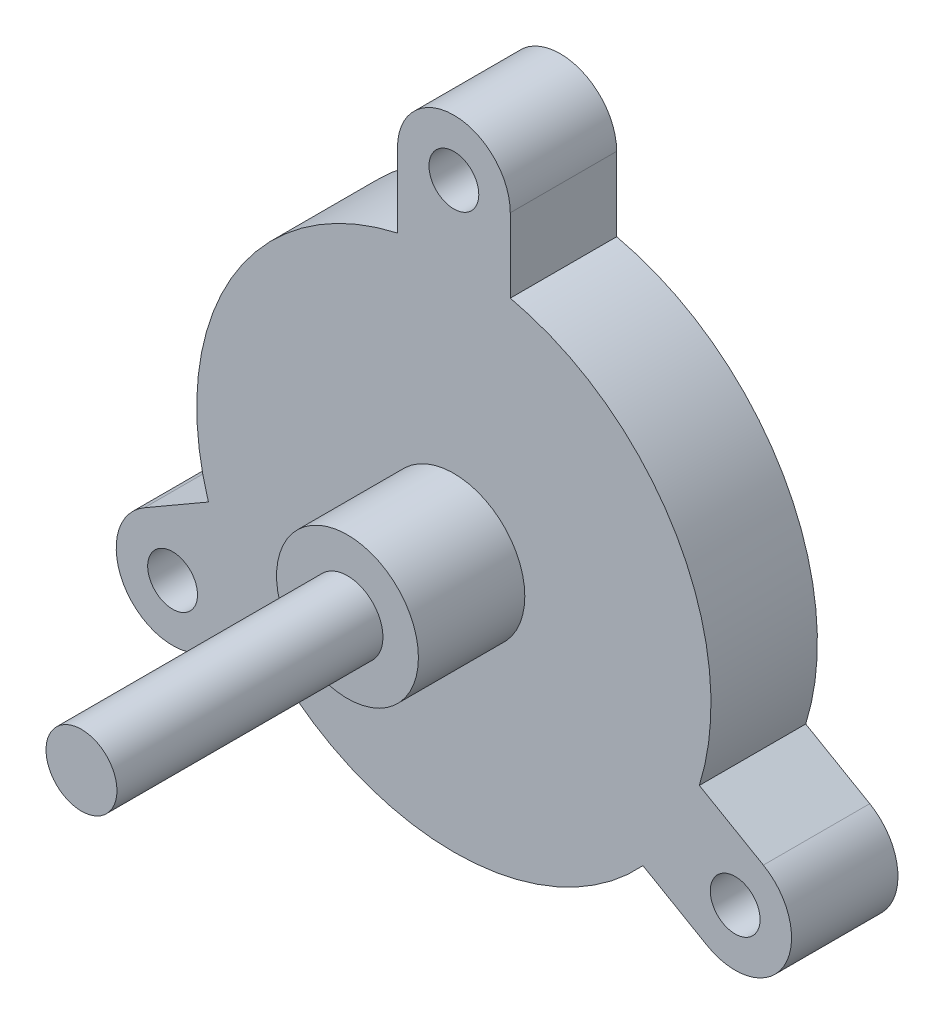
ISO-10303-21;
HEADER;
FILE_DESCRIPTION(('STEP AP214'),'2;1');
FILE_NAME('part.step','',(''),(''),'','','');
FILE_SCHEMA(('AUTOMOTIVE_DESIGN { 1 0 10303 214 1 1 1 1 }'));
ENDSEC;
DATA;
#1=APPLICATION_CONTEXT('core data for automotive mechanical design processes');
#2=APPLICATION_PROTOCOL_DEFINITION('international standard','automotive_design',2000,#1);
#3=PRODUCT_CONTEXT('',#1,'mechanical');
#4=PRODUCT('Part','Part','',(#3));
#5=PRODUCT_RELATED_PRODUCT_CATEGORY('part','',(#4));
#6=PRODUCT_DEFINITION_FORMATION('','',#4);
#7=PRODUCT_DEFINITION_CONTEXT('part definition',#1,'design');
#8=PRODUCT_DEFINITION('design','',#6,#7);
#9=PRODUCT_DEFINITION_SHAPE('','',#8);
#10=(LENGTH_UNIT() NAMED_UNIT(*) SI_UNIT(.MILLI.,.METRE.));
#11=(NAMED_UNIT(*) PLANE_ANGLE_UNIT() SI_UNIT($,.RADIAN.));
#12=(NAMED_UNIT(*) SI_UNIT($,.STERADIAN.) SOLID_ANGLE_UNIT());
#13=UNCERTAINTY_MEASURE_WITH_UNIT(LENGTH_MEASURE(1.E-05),#10,'distance_accuracy_value','');
#14=(GEOMETRIC_REPRESENTATION_CONTEXT(3) GLOBAL_UNCERTAINTY_ASSIGNED_CONTEXT((#13)) GLOBAL_UNIT_ASSIGNED_CONTEXT((#10,
#11,#12)) REPRESENTATION_CONTEXT('',''));
#15=CARTESIAN_POINT('',(0.,0.,0.));
#16=DIRECTION('',(0.,0.,1.));
#17=DIRECTION('',(1.,0.,0.));
#18=AXIS2_PLACEMENT_3D('',#15,#16,#17);
#19=CARTESIAN_POINT('',(0.,0.,6.));
#20=DIRECTION('',(0.,0.,1.));
#21=DIRECTION('',(1.,0.,0.));
#22=AXIS2_PLACEMENT_3D('',#19,#20,#21);
#23=PLANE('',#22);
#24=CARTESIAN_POINT('',(-15.8629870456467,-9.15849984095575,6.));
#25=DIRECTION('',(0.,0.,1.));
#26=DIRECTION('',(1.,0.,0.));
#27=AXIS2_PLACEMENT_3D('',#24,#25,#26);
#28=CIRCLE('',#27,1.405);
#29=CARTESIAN_POINT('',(-14.4579870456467,-9.15849984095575,6.));
#30=VERTEX_POINT('',#29);
#31=EDGE_CURVE('E241',#30,#30,#28,.T.);
#32=ORIENTED_EDGE('',*,*,#31,.F.);
#33=EDGE_LOOP('',(#32));
#34=FACE_BOUND('',#33,.T.);
#35=CARTESIAN_POINT('',(15.8629870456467,-9.15849984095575,6.));
#36=DIRECTION('',(0.,0.,1.));
#37=DIRECTION('',(-1.,0.,0.));
#38=AXIS2_PLACEMENT_3D('',#35,#36,#37);
#39=CIRCLE('',#38,1.405);
#40=CARTESIAN_POINT('',(14.4579870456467,-9.15849984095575,6.));
#41=VERTEX_POINT('',#40);
#42=EDGE_CURVE('E223',#41,#41,#39,.T.);
#43=ORIENTED_EDGE('',*,*,#42,.F.);
#44=EDGE_LOOP('',(#43));
#45=FACE_BOUND('',#44,.T.);
#46=CARTESIAN_POINT('',(0.,18.3169996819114,6.));
#47=DIRECTION('',(0.,0.,1.));
#48=DIRECTION('',(1.,0.,0.));
#49=AXIS2_PLACEMENT_3D('',#46,#47,#48);
#50=CIRCLE('',#49,1.405);
#51=CARTESIAN_POINT('',(1.405,18.3169996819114,6.));
#52=VERTEX_POINT('',#51);
#53=EDGE_CURVE('E195',#52,#52,#50,.T.);
#54=ORIENTED_EDGE('',*,*,#53,.F.);
#55=EDGE_LOOP('',(#54));
#56=FACE_BOUND('',#55,.T.);
#57=CARTESIAN_POINT('',(0.,0.,6.));
#58=DIRECTION('',(0.,0.,1.));
#59=DIRECTION('',(1.,0.,0.));
#60=AXIS2_PLACEMENT_3D('',#57,#58,#59);
#61=CIRCLE('',#60,14.5);
#62=CARTESIAN_POINT('',(-3.18,14.1469996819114,6.));
#63=VERTEX_POINT('',#62);
#64=CARTESIAN_POINT('',(-13.8416611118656,-4.31953905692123,6.));
#65=VERTEX_POINT('',#64);
#66=EDGE_CURVE('E11',#63,#65,#61,.T.);
#67=ORIENTED_EDGE('',*,*,#66,.T.);
#68=DIRECTION('',(-0.866025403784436,-0.500000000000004,0.));
#69=VECTOR('',#68,1.);
#70=CARTESIAN_POINT('',(-13.8416611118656,-4.31953905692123,6.));
#71=LINE('',#70,#69);
#72=CARTESIAN_POINT('',(-17.4529870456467,-6.40453905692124,6.));
#73=VERTEX_POINT('',#72);
#74=EDGE_CURVE('E119',#65,#73,#71,.T.);
#75=ORIENTED_EDGE('',*,*,#74,.T.);
#76=CARTESIAN_POINT('',(-15.8629870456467,-9.15849984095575,6.));
#77=DIRECTION('',(0.,0.,1.));
#78=DIRECTION('',(-1.,0.,0.));
#79=AXIS2_PLACEMENT_3D('',#76,#77,#78);
#80=CIRCLE('',#79,3.18);
#81=CARTESIAN_POINT('',(-14.2729870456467,-11.9124606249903,6.));
#82=VERTEX_POINT('',#81);
#83=EDGE_CURVE('E127',#73,#82,#80,.T.);
#84=ORIENTED_EDGE('',*,*,#83,.T.);
#85=DIRECTION('',(0.866025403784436,0.500000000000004,0.));
#86=VECTOR('',#85,1.);
#87=CARTESIAN_POINT('',(-10.6616611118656,-9.82746062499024,6.));
#88=LINE('',#87,#86);
#89=CARTESIAN_POINT('',(-10.6616611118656,-9.82746062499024,6.));
#90=VERTEX_POINT('',#89);
#91=EDGE_CURVE('E45',#82,#90,#88,.T.);
#92=ORIENTED_EDGE('',*,*,#91,.T.);
#93=CARTESIAN_POINT('',(10.6616611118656,-9.82746062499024,6.));
#94=VERTEX_POINT('',#93);
#95=EDGE_CURVE('E37',#90,#94,#61,.T.);
#96=ORIENTED_EDGE('',*,*,#95,.T.);
#97=DIRECTION('',(0.866025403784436,-0.500000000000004,0.));
#98=VECTOR('',#97,1.);
#99=CARTESIAN_POINT('',(10.6616611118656,-9.82746062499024,6.));
#100=LINE('',#99,#98);
#101=CARTESIAN_POINT('',(14.2729870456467,-11.9124606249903,6.));
#102=VERTEX_POINT('',#101);
#103=EDGE_CURVE('E217',#94,#102,#100,.T.);
#104=ORIENTED_EDGE('',*,*,#103,.T.);
#105=CARTESIAN_POINT('',(15.8629870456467,-9.15849984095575,6.));
#106=DIRECTION('',(0.,0.,1.));
#107=DIRECTION('',(1.,0.,0.));
#108=AXIS2_PLACEMENT_3D('',#105,#106,#107);
#109=CIRCLE('',#108,3.18);
#110=CARTESIAN_POINT('',(17.4529870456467,-6.40453905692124,6.));
#111=VERTEX_POINT('',#110);
#112=EDGE_CURVE('E215',#102,#111,#109,.T.);
#113=ORIENTED_EDGE('',*,*,#112,.T.);
#114=DIRECTION('',(-0.866025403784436,0.500000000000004,0.));
#115=VECTOR('',#114,1.);
#116=CARTESIAN_POINT('',(13.8416611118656,-4.31953905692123,6.));
#117=LINE('',#116,#115);
#118=CARTESIAN_POINT('',(13.8416611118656,-4.31953905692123,6.));
#119=VERTEX_POINT('',#118);
#120=EDGE_CURVE('E52',#111,#119,#117,.T.);
#121=ORIENTED_EDGE('',*,*,#120,.T.);
#122=CARTESIAN_POINT('',(3.18,14.1469996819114,6.));
#123=VERTEX_POINT('',#122);
#124=EDGE_CURVE('E38',#119,#123,#61,.T.);
#125=ORIENTED_EDGE('',*,*,#124,.T.);
#126=DIRECTION('',(0.,1.,0.));
#127=VECTOR('',#126,1.);
#128=CARTESIAN_POINT('',(3.18,14.1469996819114,6.));
#129=LINE('',#128,#127);
#130=CARTESIAN_POINT('',(3.18,18.3169996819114,6.));
#131=VERTEX_POINT('',#130);
#132=EDGE_CURVE('E182',#123,#131,#129,.T.);
#133=ORIENTED_EDGE('',*,*,#132,.T.);
#134=CARTESIAN_POINT('',(0.,18.3169996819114,6.));
#135=DIRECTION('',(0.,0.,1.));
#136=DIRECTION('',(-1.,0.,0.));
#137=AXIS2_PLACEMENT_3D('',#134,#135,#136);
#138=CIRCLE('',#137,3.18);
#139=CARTESIAN_POINT('',(-3.18,18.3169996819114,6.));
#140=VERTEX_POINT('',#139);
#141=EDGE_CURVE('E145',#131,#140,#138,.T.);
#142=ORIENTED_EDGE('',*,*,#141,.T.);
#143=DIRECTION('',(0.,-1.,0.));
#144=VECTOR('',#143,1.);
#145=CARTESIAN_POINT('',(-3.18,14.1469996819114,6.));
#146=LINE('',#145,#144);
#147=EDGE_CURVE('E141',#140,#63,#146,.T.);
#148=ORIENTED_EDGE('',*,*,#147,.T.);
#149=EDGE_LOOP('',(#67,#75,#84,#92,#96,#104,#113,#121,#125,#133,#142,#148));
#150=FACE_BOUND('',#149,.T.);
#151=CARTESIAN_POINT('',(0.,0.,6.));
#152=DIRECTION('',(0.,0.,1.));
#153=DIRECTION('',(1.,0.,0.));
#154=AXIS2_PLACEMENT_3D('',#151,#152,#153);
#155=CIRCLE('',#154,4.);
#156=CARTESIAN_POINT('',(4.,0.,6.));
#157=VERTEX_POINT('',#156);
#158=EDGE_CURVE('E256',#157,#157,#155,.T.);
#159=ORIENTED_EDGE('',*,*,#158,.F.);
#160=EDGE_LOOP('',(#159));
#161=FACE_BOUND('',#160,.T.);
#162=ADVANCED_FACE('F29',(#34,#45,#56,#150,#161),#23,.T.);
#163=CARTESIAN_POINT('',(0.,0.,6.));
#164=DIRECTION('',(0.,0.,-1.));
#165=DIRECTION('',(-1.,0.,0.));
#166=AXIS2_PLACEMENT_3D('',#163,#164,#165);
#167=CYLINDRICAL_SURFACE('',#166,12.5);
#168=CARTESIAN_POINT('',(0.,0.,0.));
#169=DIRECTION('',(0.,0.,1.));
#170=DIRECTION('',(1.,0.,0.));
#171=AXIS2_PLACEMENT_3D('',#168,#169,#170);
#172=CIRCLE('',#171,12.5);
#173=CARTESIAN_POINT('',(12.5,0.,0.));
#174=VERTEX_POINT('',#173);
#175=EDGE_CURVE('E153',#174,#174,#172,.T.);
#176=ORIENTED_EDGE('',*,*,#175,.F.);
#177=EDGE_LOOP('',(#176));
#178=FACE_BOUND('',#177,.T.);
#179=CARTESIAN_POINT('',(0.,0.,4.));
#180=DIRECTION('',(0.,0.,1.));
#181=DIRECTION('',(1.,0.,0.));
#182=AXIS2_PLACEMENT_3D('',#179,#180,#181);
#183=CIRCLE('',#182,12.5);
#184=CARTESIAN_POINT('',(12.5,0.,4.));
#185=VERTEX_POINT('',#184);
#186=EDGE_CURVE('E244',#185,#185,#183,.T.);
#187=ORIENTED_EDGE('',*,*,#186,.T.);
#188=EDGE_LOOP('',(#187));
#189=FACE_BOUND('',#188,.T.);
#190=ADVANCED_FACE('F292',(#178,#189),#167,.F.);
#191=CARTESIAN_POINT('',(0.,0.,6.));
#192=DIRECTION('',(0.,0.,-1.));
#193=DIRECTION('',(-1.,0.,0.));
#194=AXIS2_PLACEMENT_3D('',#191,#192,#193);
#195=CYLINDRICAL_SURFACE('',#194,14.5);
#196=ORIENTED_EDGE('',*,*,#95,.F.);
#197=DIRECTION('',(0.,0.,1.));
#198=VECTOR('',#197,1.);
#199=CARTESIAN_POINT('',(-10.6616611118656,-9.82746062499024,0.));
#200=LINE('',#199,#198);
#201=CARTESIAN_POINT('',(-10.6616611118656,-9.82746062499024,0.));
#202=VERTEX_POINT('',#201);
#203=EDGE_CURVE('E225',#202,#90,#200,.T.);
#204=ORIENTED_EDGE('',*,*,#203,.F.);
#205=CARTESIAN_POINT('',(0.,0.,0.));
#206=DIRECTION('',(0.,0.,1.));
#207=DIRECTION('',(1.,0.,0.));
#208=AXIS2_PLACEMENT_3D('',#205,#206,#207);
#209=CIRCLE('',#208,14.5);
#210=CARTESIAN_POINT('',(10.6616611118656,-9.82746062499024,0.));
#211=VERTEX_POINT('',#210);
#212=EDGE_CURVE('E167',#202,#211,#209,.T.);
#213=ORIENTED_EDGE('',*,*,#212,.T.);
#214=DIRECTION('',(0.,0.,1.));
#215=VECTOR('',#214,1.);
#216=CARTESIAN_POINT('',(10.6616611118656,-9.82746062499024,0.));
#217=LINE('',#216,#215);
#218=EDGE_CURVE('E198',#211,#94,#217,.T.);
#219=ORIENTED_EDGE('',*,*,#218,.T.);
#220=EDGE_LOOP('',(#196,#204,#213,#219));
#221=FACE_BOUND('',#220,.T.);
#222=ADVANCED_FACE('F297',(#221),#195,.T.);
#223=ORIENTED_EDGE('',*,*,#124,.F.);
#224=DIRECTION('',(0.,0.,1.));
#225=VECTOR('',#224,1.);
#226=CARTESIAN_POINT('',(13.8416611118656,-4.31953905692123,0.));
#227=LINE('',#226,#225);
#228=CARTESIAN_POINT('',(13.8416611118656,-4.31953905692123,0.));
#229=VERTEX_POINT('',#228);
#230=EDGE_CURVE('E174',#229,#119,#227,.T.);
#231=ORIENTED_EDGE('',*,*,#230,.F.);
#232=CARTESIAN_POINT('',(3.18,14.1469996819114,0.));
#233=VERTEX_POINT('',#232);
#234=EDGE_CURVE('E157',#229,#233,#209,.T.);
#235=ORIENTED_EDGE('',*,*,#234,.T.);
#236=DIRECTION('',(0.,0.,1.));
#237=VECTOR('',#236,1.);
#238=CARTESIAN_POINT('',(3.18,14.1469996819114,0.));
#239=LINE('',#238,#237);
#240=EDGE_CURVE('E165',#233,#123,#239,.T.);
#241=ORIENTED_EDGE('',*,*,#240,.T.);
#242=EDGE_LOOP('',(#223,#231,#235,#241));
#243=FACE_BOUND('',#242,.T.);
#244=ADVANCED_FACE('F173',(#243),#195,.T.);
#245=CARTESIAN_POINT('',(0.,0.,0.));
#246=DIRECTION('',(0.,0.,1.));
#247=DIRECTION('',(1.,0.,0.));
#248=AXIS2_PLACEMENT_3D('',#245,#246,#247);
#249=PLANE('',#248);
#250=CARTESIAN_POINT('',(-3.18,14.1469996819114,0.));
#251=VERTEX_POINT('',#250);
#252=CARTESIAN_POINT('',(-13.8416611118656,-4.31953905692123,0.));
#253=VERTEX_POINT('',#252);
#254=EDGE_CURVE('E135',#251,#253,#209,.T.);
#255=ORIENTED_EDGE('',*,*,#254,.F.);
#256=DIRECTION('',(0.,-1.,0.));
#257=VECTOR('',#256,1.);
#258=CARTESIAN_POINT('',(-3.18,14.1469996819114,0.));
#259=LINE('',#258,#257);
#260=CARTESIAN_POINT('',(-3.18,18.3169996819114,0.));
#261=VERTEX_POINT('',#260);
#262=EDGE_CURVE('E152',#261,#251,#259,.T.);
#263=ORIENTED_EDGE('',*,*,#262,.F.);
#264=CARTESIAN_POINT('',(0.,18.3169996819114,0.));
#265=DIRECTION('',(0.,0.,1.));
#266=DIRECTION('',(-1.,0.,0.));
#267=AXIS2_PLACEMENT_3D('',#264,#265,#266);
#268=CIRCLE('',#267,3.18);
#269=CARTESIAN_POINT('',(3.18,18.3169996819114,0.));
#270=VERTEX_POINT('',#269);
#271=EDGE_CURVE('E187',#270,#261,#268,.T.);
#272=ORIENTED_EDGE('',*,*,#271,.F.);
#273=DIRECTION('',(0.,1.,0.));
#274=VECTOR('',#273,1.);
#275=CARTESIAN_POINT('',(3.18,14.1469996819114,0.));
#276=LINE('',#275,#274);
#277=EDGE_CURVE('E147',#233,#270,#276,.T.);
#278=ORIENTED_EDGE('',*,*,#277,.F.);
#279=ORIENTED_EDGE('',*,*,#234,.F.);
#280=DIRECTION('',(-0.866025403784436,0.500000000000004,0.));
#281=VECTOR('',#280,1.);
#282=CARTESIAN_POINT('',(13.8416611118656,-4.31953905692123,0.));
#283=LINE('',#282,#281);
#284=CARTESIAN_POINT('',(17.4529870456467,-6.40453905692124,0.));
#285=VERTEX_POINT('',#284);
#286=EDGE_CURVE('E202',#285,#229,#283,.T.);
#287=ORIENTED_EDGE('',*,*,#286,.F.);
#288=CARTESIAN_POINT('',(15.8629870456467,-9.15849984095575,0.));
#289=DIRECTION('',(0.,0.,1.));
#290=DIRECTION('',(1.,0.,0.));
#291=AXIS2_PLACEMENT_3D('',#288,#289,#290);
#292=CIRCLE('',#291,3.18);
#293=CARTESIAN_POINT('',(14.2729870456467,-11.9124606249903,0.));
#294=VERTEX_POINT('',#293);
#295=EDGE_CURVE('E208',#294,#285,#292,.T.);
#296=ORIENTED_EDGE('',*,*,#295,.F.);
#297=DIRECTION('',(0.866025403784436,-0.500000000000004,0.));
#298=VECTOR('',#297,1.);
#299=CARTESIAN_POINT('',(10.6616611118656,-9.82746062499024,0.));
#300=LINE('',#299,#298);
#301=EDGE_CURVE('E211',#211,#294,#300,.T.);
#302=ORIENTED_EDGE('',*,*,#301,.F.);
#303=ORIENTED_EDGE('',*,*,#212,.F.);
#304=DIRECTION('',(0.866025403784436,0.500000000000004,0.));
#305=VECTOR('',#304,1.);
#306=CARTESIAN_POINT('',(-10.6616611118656,-9.82746062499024,0.));
#307=LINE('',#306,#305);
#308=CARTESIAN_POINT('',(-14.2729870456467,-11.9124606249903,0.));
#309=VERTEX_POINT('',#308);
#310=EDGE_CURVE('E136',#309,#202,#307,.T.);
#311=ORIENTED_EDGE('',*,*,#310,.F.);
#312=CARTESIAN_POINT('',(-15.8629870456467,-9.15849984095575,0.));
#313=DIRECTION('',(0.,0.,1.));
#314=DIRECTION('',(-1.,0.,0.));
#315=AXIS2_PLACEMENT_3D('',#312,#313,#314);
#316=CIRCLE('',#315,3.18);
#317=CARTESIAN_POINT('',(-17.4529870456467,-6.40453905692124,0.));
#318=VERTEX_POINT('',#317);
#319=EDGE_CURVE('E232',#318,#309,#316,.T.);
#320=ORIENTED_EDGE('',*,*,#319,.F.);
#321=DIRECTION('',(-0.866025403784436,-0.500000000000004,0.));
#322=VECTOR('',#321,1.);
#323=CARTESIAN_POINT('',(-13.8416611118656,-4.31953905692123,0.));
#324=LINE('',#323,#322);
#325=EDGE_CURVE('E235',#253,#318,#324,.T.);
#326=ORIENTED_EDGE('',*,*,#325,.F.);
#327=EDGE_LOOP('',(#255,#263,#272,#278,#279,#287,#296,#302,#303,#311,#320,#326));
#328=FACE_BOUND('',#327,.T.);
#329=ORIENTED_EDGE('',*,*,#175,.T.);
#330=EDGE_LOOP('',(#329));
#331=FACE_BOUND('',#330,.T.);
#332=CARTESIAN_POINT('',(0.,18.3169996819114,0.));
#333=DIRECTION('',(0.,0.,1.));
#334=DIRECTION('',(1.,0.,0.));
#335=AXIS2_PLACEMENT_3D('',#332,#333,#334);
#336=CIRCLE('',#335,1.405);
#337=CARTESIAN_POINT('',(1.405,18.3169996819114,0.));
#338=VERTEX_POINT('',#337);
#339=EDGE_CURVE('E192',#338,#338,#336,.T.);
#340=ORIENTED_EDGE('',*,*,#339,.T.);
#341=EDGE_LOOP('',(#340));
#342=FACE_BOUND('',#341,.T.);
#343=CARTESIAN_POINT('',(15.8629870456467,-9.15849984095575,0.));
#344=DIRECTION('',(0.,0.,1.));
#345=DIRECTION('',(-1.,0.,0.));
#346=AXIS2_PLACEMENT_3D('',#343,#344,#345);
#347=CIRCLE('',#346,1.405);
#348=CARTESIAN_POINT('',(14.4579870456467,-9.15849984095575,0.));
#349=VERTEX_POINT('',#348);
#350=EDGE_CURVE('E220',#349,#349,#347,.T.);
#351=ORIENTED_EDGE('',*,*,#350,.T.);
#352=EDGE_LOOP('',(#351));
#353=FACE_BOUND('',#352,.T.);
#354=CARTESIAN_POINT('',(-15.8629870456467,-9.15849984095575,0.));
#355=DIRECTION('',(0.,0.,1.));
#356=DIRECTION('',(1.,0.,0.));
#357=AXIS2_PLACEMENT_3D('',#354,#355,#356);
#358=CIRCLE('',#357,1.405);
#359=CARTESIAN_POINT('',(-14.4579870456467,-9.15849984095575,0.));
#360=VERTEX_POINT('',#359);
#361=EDGE_CURVE('E128',#360,#360,#358,.T.);
#362=ORIENTED_EDGE('',*,*,#361,.T.);
#363=EDGE_LOOP('',(#362));
#364=FACE_BOUND('',#363,.T.);
#365=ADVANCED_FACE('F184',(#328,#331,#342,#353,#364),#249,.F.);
#366=ORIENTED_EDGE('',*,*,#254,.T.);
#367=DIRECTION('',(0.,0.,1.));
#368=VECTOR('',#367,1.);
#369=CARTESIAN_POINT('',(-13.8416611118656,-4.31953905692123,0.));
#370=LINE('',#369,#368);
#371=EDGE_CURVE('E123',#253,#65,#370,.T.);
#372=ORIENTED_EDGE('',*,*,#371,.T.);
#373=ORIENTED_EDGE('',*,*,#66,.F.);
#374=DIRECTION('',(0.,0.,1.));
#375=VECTOR('',#374,1.);
#376=CARTESIAN_POINT('',(-3.18,14.1469996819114,0.));
#377=LINE('',#376,#375);
#378=EDGE_CURVE('E149',#251,#63,#377,.T.);
#379=ORIENTED_EDGE('',*,*,#378,.F.);
#380=EDGE_LOOP('',(#366,#372,#373,#379));
#381=FACE_BOUND('',#380,.T.);
#382=ADVANCED_FACE('F31',(#381),#195,.T.);
#383=CARTESIAN_POINT('',(-3.18,14.1469996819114,0.));
#384=DIRECTION('',(-1.,0.,0.));
#385=DIRECTION('',(0.,0.,1.));
#386=AXIS2_PLACEMENT_3D('',#383,#384,#385);
#387=PLANE('',#386);
#388=ORIENTED_EDGE('',*,*,#147,.F.);
#389=DIRECTION('',(0.,0.,1.));
#390=VECTOR('',#389,1.);
#391=CARTESIAN_POINT('',(-3.18,18.3169996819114,0.));
#392=LINE('',#391,#390);
#393=EDGE_CURVE('E154',#261,#140,#392,.T.);
#394=ORIENTED_EDGE('',*,*,#393,.F.);
#395=ORIENTED_EDGE('',*,*,#262,.T.);
#396=ORIENTED_EDGE('',*,*,#378,.T.);
#397=EDGE_LOOP('',(#388,#394,#395,#396));
#398=FACE_BOUND('',#397,.T.);
#399=ADVANCED_FACE('F150',(#398),#387,.T.);
#400=CARTESIAN_POINT('',(0.,18.3169996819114,0.));
#401=DIRECTION('',(0.,0.,1.));
#402=DIRECTION('',(1.,0.,0.));
#403=AXIS2_PLACEMENT_3D('',#400,#401,#402);
#404=CYLINDRICAL_SURFACE('',#403,3.18);
#405=ORIENTED_EDGE('',*,*,#141,.F.);
#406=DIRECTION('',(0.,0.,1.));
#407=VECTOR('',#406,1.);
#408=CARTESIAN_POINT('',(3.18,18.3169996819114,0.));
#409=LINE('',#408,#407);
#410=EDGE_CURVE('E159',#270,#131,#409,.T.);
#411=ORIENTED_EDGE('',*,*,#410,.F.);
#412=ORIENTED_EDGE('',*,*,#271,.T.);
#413=ORIENTED_EDGE('',*,*,#393,.T.);
#414=EDGE_LOOP('',(#405,#411,#412,#413));
#415=FACE_BOUND('',#414,.T.);
#416=ADVANCED_FACE('F308',(#415),#404,.T.);
#417=CARTESIAN_POINT('',(3.18,14.1469996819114,0.));
#418=DIRECTION('',(1.,0.,0.));
#419=DIRECTION('',(0.,0.,-1.));
#420=AXIS2_PLACEMENT_3D('',#417,#418,#419);
#421=PLANE('',#420);
#422=ORIENTED_EDGE('',*,*,#132,.F.);
#423=ORIENTED_EDGE('',*,*,#240,.F.);
#424=ORIENTED_EDGE('',*,*,#277,.T.);
#425=ORIENTED_EDGE('',*,*,#410,.T.);
#426=EDGE_LOOP('',(#422,#423,#424,#425));
#427=FACE_BOUND('',#426,.T.);
#428=ADVANCED_FACE('F181',(#427),#421,.T.);
#429=CARTESIAN_POINT('',(0.,18.3169996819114,0.));
#430=DIRECTION('',(0.,0.,1.));
#431=DIRECTION('',(1.,0.,0.));
#432=AXIS2_PLACEMENT_3D('',#429,#430,#431);
#433=CYLINDRICAL_SURFACE('',#432,1.405);
#434=ORIENTED_EDGE('',*,*,#339,.F.);
#435=EDGE_LOOP('',(#434));
#436=FACE_BOUND('',#435,.T.);
#437=ORIENTED_EDGE('',*,*,#53,.T.);
#438=EDGE_LOOP('',(#437));
#439=FACE_BOUND('',#438,.T.);
#440=ADVANCED_FACE('F307',(#436,#439),#433,.F.);
#441=CARTESIAN_POINT('',(13.8416611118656,-4.31953905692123,0.));
#442=DIRECTION('',(0.500000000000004,0.866025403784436,0.));
#443=DIRECTION('',(-0.866025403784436,0.500000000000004,0.));
#444=AXIS2_PLACEMENT_3D('',#441,#442,#443);
#445=PLANE('',#444);
#446=ORIENTED_EDGE('',*,*,#120,.F.);
#447=DIRECTION('',(0.,0.,1.));
#448=VECTOR('',#447,1.);
#449=CARTESIAN_POINT('',(17.4529870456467,-6.40453905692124,0.));
#450=LINE('',#449,#448);
#451=EDGE_CURVE('E204',#285,#111,#450,.T.);
#452=ORIENTED_EDGE('',*,*,#451,.F.);
#453=ORIENTED_EDGE('',*,*,#286,.T.);
#454=ORIENTED_EDGE('',*,*,#230,.T.);
#455=EDGE_LOOP('',(#446,#452,#453,#454));
#456=FACE_BOUND('',#455,.T.);
#457=ADVANCED_FACE('F316',(#456),#445,.T.);
#458=CARTESIAN_POINT('',(15.8629870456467,-9.15849984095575,0.));
#459=DIRECTION('',(0.,0.,1.));
#460=DIRECTION('',(1.,0.,0.));
#461=AXIS2_PLACEMENT_3D('',#458,#459,#460);
#462=CYLINDRICAL_SURFACE('',#461,3.18);
#463=ORIENTED_EDGE('',*,*,#112,.F.);
#464=DIRECTION('',(0.,0.,1.));
#465=VECTOR('',#464,1.);
#466=CARTESIAN_POINT('',(14.2729870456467,-11.9124606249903,0.));
#467=LINE('',#466,#465);
#468=EDGE_CURVE('E201',#294,#102,#467,.T.);
#469=ORIENTED_EDGE('',*,*,#468,.F.);
#470=ORIENTED_EDGE('',*,*,#295,.T.);
#471=ORIENTED_EDGE('',*,*,#451,.T.);
#472=EDGE_LOOP('',(#463,#469,#470,#471));
#473=FACE_BOUND('',#472,.T.);
#474=ADVANCED_FACE('F322',(#473),#462,.T.);
#475=CARTESIAN_POINT('',(10.6616611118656,-9.82746062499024,0.));
#476=DIRECTION('',(-0.500000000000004,-0.866025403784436,0.));
#477=DIRECTION('',(0.866025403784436,-0.500000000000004,0.));
#478=AXIS2_PLACEMENT_3D('',#475,#476,#477);
#479=PLANE('',#478);
#480=ORIENTED_EDGE('',*,*,#103,.F.);
#481=ORIENTED_EDGE('',*,*,#218,.F.);
#482=ORIENTED_EDGE('',*,*,#301,.T.);
#483=ORIENTED_EDGE('',*,*,#468,.T.);
#484=EDGE_LOOP('',(#480,#481,#482,#483));
#485=FACE_BOUND('',#484,.T.);
#486=ADVANCED_FACE('F318',(#485),#479,.T.);
#487=CARTESIAN_POINT('',(15.8629870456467,-9.15849984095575,0.));
#488=DIRECTION('',(0.,0.,1.));
#489=DIRECTION('',(1.,0.,0.));
#490=AXIS2_PLACEMENT_3D('',#487,#488,#489);
#491=CYLINDRICAL_SURFACE('',#490,1.405);
#492=ORIENTED_EDGE('',*,*,#350,.F.);
#493=EDGE_LOOP('',(#492));
#494=FACE_BOUND('',#493,.T.);
#495=ORIENTED_EDGE('',*,*,#42,.T.);
#496=EDGE_LOOP('',(#495));
#497=FACE_BOUND('',#496,.T.);
#498=ADVANCED_FACE('F321',(#494,#497),#491,.F.);
#499=CARTESIAN_POINT('',(-10.6616611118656,-9.82746062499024,0.));
#500=DIRECTION('',(0.500000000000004,-0.866025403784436,0.));
#501=DIRECTION('',(0.866025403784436,0.500000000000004,0.));
#502=AXIS2_PLACEMENT_3D('',#499,#500,#501);
#503=PLANE('',#502);
#504=ORIENTED_EDGE('',*,*,#91,.F.);
#505=DIRECTION('',(0.,0.,1.));
#506=VECTOR('',#505,1.);
#507=CARTESIAN_POINT('',(-14.2729870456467,-11.9124606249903,0.));
#508=LINE('',#507,#506);
#509=EDGE_CURVE('E228',#309,#82,#508,.T.);
#510=ORIENTED_EDGE('',*,*,#509,.F.);
#511=ORIENTED_EDGE('',*,*,#310,.T.);
#512=ORIENTED_EDGE('',*,*,#203,.T.);
#513=EDGE_LOOP('',(#504,#510,#511,#512));
#514=FACE_BOUND('',#513,.T.);
#515=ADVANCED_FACE('F332',(#514),#503,.T.);
#516=CARTESIAN_POINT('',(-15.8629870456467,-9.15849984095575,0.));
#517=DIRECTION('',(0.,0.,1.));
#518=DIRECTION('',(1.,0.,0.));
#519=AXIS2_PLACEMENT_3D('',#516,#517,#518);
#520=CYLINDRICAL_SURFACE('',#519,3.18);
#521=ORIENTED_EDGE('',*,*,#83,.F.);
#522=DIRECTION('',(0.,0.,1.));
#523=VECTOR('',#522,1.);
#524=CARTESIAN_POINT('',(-17.4529870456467,-6.40453905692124,0.));
#525=LINE('',#524,#523);
#526=EDGE_CURVE('E125',#318,#73,#525,.T.);
#527=ORIENTED_EDGE('',*,*,#526,.F.);
#528=ORIENTED_EDGE('',*,*,#319,.T.);
#529=ORIENTED_EDGE('',*,*,#509,.T.);
#530=EDGE_LOOP('',(#521,#527,#528,#529));
#531=FACE_BOUND('',#530,.T.);
#532=ADVANCED_FACE('F337',(#531),#520,.T.);
#533=CARTESIAN_POINT('',(-13.8416611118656,-4.31953905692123,0.));
#534=DIRECTION('',(-0.500000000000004,0.866025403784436,0.));
#535=DIRECTION('',(-0.866025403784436,-0.500000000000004,0.));
#536=AXIS2_PLACEMENT_3D('',#533,#534,#535);
#537=PLANE('',#536);
#538=ORIENTED_EDGE('',*,*,#74,.F.);
#539=ORIENTED_EDGE('',*,*,#371,.F.);
#540=ORIENTED_EDGE('',*,*,#325,.T.);
#541=ORIENTED_EDGE('',*,*,#526,.T.);
#542=EDGE_LOOP('',(#538,#539,#540,#541));
#543=FACE_BOUND('',#542,.T.);
#544=ADVANCED_FACE('F121',(#543),#537,.T.);
#545=CARTESIAN_POINT('',(-15.8629870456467,-9.15849984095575,0.));
#546=DIRECTION('',(0.,0.,1.));
#547=DIRECTION('',(1.,0.,0.));
#548=AXIS2_PLACEMENT_3D('',#545,#546,#547);
#549=CYLINDRICAL_SURFACE('',#548,1.405);
#550=ORIENTED_EDGE('',*,*,#361,.F.);
#551=EDGE_LOOP('',(#550));
#552=FACE_BOUND('',#551,.T.);
#553=ORIENTED_EDGE('',*,*,#31,.T.);
#554=EDGE_LOOP('',(#553));
#555=FACE_BOUND('',#554,.T.);
#556=ADVANCED_FACE('F336',(#552,#555),#549,.F.);
#557=CARTESIAN_POINT('',(0.,0.,4.));
#558=DIRECTION('',(0.,0.,1.));
#559=DIRECTION('',(1.,0.,0.));
#560=AXIS2_PLACEMENT_3D('',#557,#558,#559);
#561=PLANE('',#560);
#562=CARTESIAN_POINT('',(0.,0.,4.));
#563=DIRECTION('',(0.,0.,1.));
#564=DIRECTION('',(1.,0.,0.));
#565=AXIS2_PLACEMENT_3D('',#562,#563,#564);
#566=CIRCLE('',#565,2.1);
#567=CARTESIAN_POINT('',(2.1,0.,4.));
#568=VERTEX_POINT('',#567);
#569=EDGE_CURVE('E247',#568,#568,#566,.T.);
#570=ORIENTED_EDGE('',*,*,#569,.T.);
#571=EDGE_LOOP('',(#570));
#572=FACE_BOUND('',#571,.T.);
#573=ORIENTED_EDGE('',*,*,#186,.F.);
#574=EDGE_LOOP('',(#573));
#575=FACE_BOUND('',#574,.T.);
#576=ADVANCED_FACE('F346',(#572,#575),#561,.F.);
#577=CARTESIAN_POINT('',(0.,0.,4.));
#578=DIRECTION('',(0.,0.,1.));
#579=DIRECTION('',(1.,0.,0.));
#580=AXIS2_PLACEMENT_3D('',#577,#578,#579);
#581=CYLINDRICAL_SURFACE('',#580,2.1);
#582=ORIENTED_EDGE('',*,*,#569,.F.);
#583=EDGE_LOOP('',(#582));
#584=FACE_BOUND('',#583,.T.);
#585=CARTESIAN_POINT('',(0.,0.,6.));
#586=DIRECTION('',(0.,0.,1.));
#587=DIRECTION('',(1.,0.,0.));
#588=AXIS2_PLACEMENT_3D('',#585,#586,#587);
#589=CIRCLE('',#588,2.1);
#590=CARTESIAN_POINT('',(2.1,0.,6.));
#591=VERTEX_POINT('',#590);
#592=EDGE_CURVE('E250',#591,#591,#589,.F.);
#593=ORIENTED_EDGE('',*,*,#592,.F.);
#594=EDGE_LOOP('',(#593));
#595=FACE_BOUND('',#594,.T.);
#596=ADVANCED_FACE('F350',(#584,#595),#581,.F.);
#597=CARTESIAN_POINT('',(0.,0.,6.));
#598=DIRECTION('',(0.,0.,1.));
#599=DIRECTION('',(1.,0.,0.));
#600=AXIS2_PLACEMENT_3D('',#597,#598,#599);
#601=PLANE('',#600);
#602=CARTESIAN_POINT('',(0.,0.,6.));
#603=DIRECTION('',(0.,0.,1.));
#604=DIRECTION('',(1.,0.,0.));
#605=AXIS2_PLACEMENT_3D('',#602,#603,#604);
#606=CIRCLE('',#605,2.);
#607=CARTESIAN_POINT('',(2.,0.,6.));
#608=VERTEX_POINT('',#607);
#609=EDGE_CURVE('E262',#608,#608,#606,.F.);
#610=ORIENTED_EDGE('',*,*,#609,.F.);
#611=EDGE_LOOP('',(#610));
#612=FACE_BOUND('',#611,.T.);
#613=ORIENTED_EDGE('',*,*,#592,.T.);
#614=EDGE_LOOP('',(#613));
#615=FACE_BOUND('',#614,.T.);
#616=ADVANCED_FACE('F353',(#612,#615),#601,.F.);
#617=CARTESIAN_POINT('',(0.,0.,12.));
#618=DIRECTION('',(0.,0.,1.));
#619=DIRECTION('',(1.,0.,0.));
#620=AXIS2_PLACEMENT_3D('',#617,#618,#619);
#621=PLANE('',#620);
#622=CARTESIAN_POINT('',(0.,0.,12.));
#623=DIRECTION('',(0.,0.,1.));
#624=DIRECTION('',(1.,0.,0.));
#625=AXIS2_PLACEMENT_3D('',#622,#623,#624);
#626=CIRCLE('',#625,4.);
#627=CARTESIAN_POINT('',(4.,0.,12.));
#628=VERTEX_POINT('',#627);
#629=EDGE_CURVE('E253',#628,#628,#626,.T.);
#630=ORIENTED_EDGE('',*,*,#629,.T.);
#631=EDGE_LOOP('',(#630));
#632=FACE_BOUND('',#631,.T.);
#633=CARTESIAN_POINT('',(0.,0.,12.));
#634=DIRECTION('',(0.,0.,1.));
#635=DIRECTION('',(1.,0.,0.));
#636=AXIS2_PLACEMENT_3D('',#633,#634,#635);
#637=CIRCLE('',#636,2.);
#638=CARTESIAN_POINT('',(2.,0.,12.));
#639=VERTEX_POINT('',#638);
#640=EDGE_CURVE('E259',#639,#639,#637,.T.);
#641=ORIENTED_EDGE('',*,*,#640,.F.);
#642=EDGE_LOOP('',(#641));
#643=FACE_BOUND('',#642,.T.);
#644=ADVANCED_FACE('F286',(#632,#643),#621,.T.);
#645=CARTESIAN_POINT('',(0.,0.,12.));
#646=DIRECTION('',(0.,0.,-1.));
#647=DIRECTION('',(-1.,0.,0.));
#648=AXIS2_PLACEMENT_3D('',#645,#646,#647);
#649=CYLINDRICAL_SURFACE('',#648,4.);
#650=ORIENTED_EDGE('',*,*,#629,.F.);
#651=EDGE_LOOP('',(#650));
#652=FACE_BOUND('',#651,.T.);
#653=ORIENTED_EDGE('',*,*,#158,.T.);
#654=EDGE_LOOP('',(#653));
#655=FACE_BOUND('',#654,.T.);
#656=ADVANCED_FACE('F277',(#652,#655),#649,.T.);
#657=CARTESIAN_POINT('',(0.,0.,22.));
#658=DIRECTION('',(0.,0.,-1.));
#659=DIRECTION('',(-1.,0.,0.));
#660=AXIS2_PLACEMENT_3D('',#657,#658,#659);
#661=CYLINDRICAL_SURFACE('',#660,2.);
#662=ORIENTED_EDGE('',*,*,#640,.T.);
#663=EDGE_LOOP('',(#662));
#664=FACE_BOUND('',#663,.T.);
#665=CARTESIAN_POINT('',(0.,0.,27.));
#666=DIRECTION('',(0.,0.,1.));
#667=DIRECTION('',(1.,0.,0.));
#668=AXIS2_PLACEMENT_3D('',#665,#666,#667);
#669=CIRCLE('',#668,2.);
#670=CARTESIAN_POINT('',(2.,0.,27.));
#671=VERTEX_POINT('',#670);
#672=EDGE_CURVE('E268',#671,#671,#669,.T.);
#673=ORIENTED_EDGE('',*,*,#672,.F.);
#674=EDGE_LOOP('',(#673));
#675=FACE_BOUND('',#674,.T.);
#676=ADVANCED_FACE('F274',(#664,#675),#661,.T.);
#677=CARTESIAN_POINT('',(0.,0.,-8.));
#678=DIRECTION('',(0.,0.,1.));
#679=DIRECTION('',(1.,0.,0.));
#680=AXIS2_PLACEMENT_3D('',#677,#678,#679);
#681=CIRCLE('',#680,2.);
#682=CARTESIAN_POINT('',(2.,0.,-8.));
#683=VERTEX_POINT('',#682);
#684=EDGE_CURVE('E265',#683,#683,#681,.T.);
#685=ORIENTED_EDGE('',*,*,#684,.T.);
#686=EDGE_LOOP('',(#685));
#687=FACE_BOUND('',#686,.T.);
#688=ORIENTED_EDGE('',*,*,#609,.T.);
#689=EDGE_LOOP('',(#688));
#690=FACE_BOUND('',#689,.T.);
#691=ADVANCED_FACE('F276',(#687,#690),#661,.T.);
#692=CARTESIAN_POINT('',(0.,0.,-8.));
#693=DIRECTION('',(0.,0.,1.));
#694=DIRECTION('',(1.,0.,0.));
#695=AXIS2_PLACEMENT_3D('',#692,#693,#694);
#696=PLANE('',#695);
#697=ORIENTED_EDGE('',*,*,#684,.F.);
#698=EDGE_LOOP('',(#697));
#699=FACE_BOUND('',#698,.T.);
#700=ADVANCED_FACE('F284',(#699),#696,.F.);
#701=CARTESIAN_POINT('',(0.,0.,27.));
#702=DIRECTION('',(0.,0.,1.));
#703=DIRECTION('',(1.,0.,0.));
#704=AXIS2_PLACEMENT_3D('',#701,#702,#703);
#705=PLANE('',#704);
#706=ORIENTED_EDGE('',*,*,#672,.T.);
#707=EDGE_LOOP('',(#706));
#708=FACE_BOUND('',#707,.T.);
#709=ADVANCED_FACE('F272',(#708),#705,.T.);
#710=CLOSED_SHELL('',(#162,#190,#222,#244,#365,#382,#399,#416,#428,#440,#457,#474,#486,#498,
#515,#532,#544,#556,#576,#596,#616,#644,#656,#676,#691,#700,#709));
#711=MANIFOLD_SOLID_BREP('B2',#710);
#712=ADVANCED_BREP_SHAPE_REPRESENTATION('',(#18,#711),#14);
#713=SHAPE_DEFINITION_REPRESENTATION(#9,#712);
ENDSEC;
END-ISO-10303-21;
